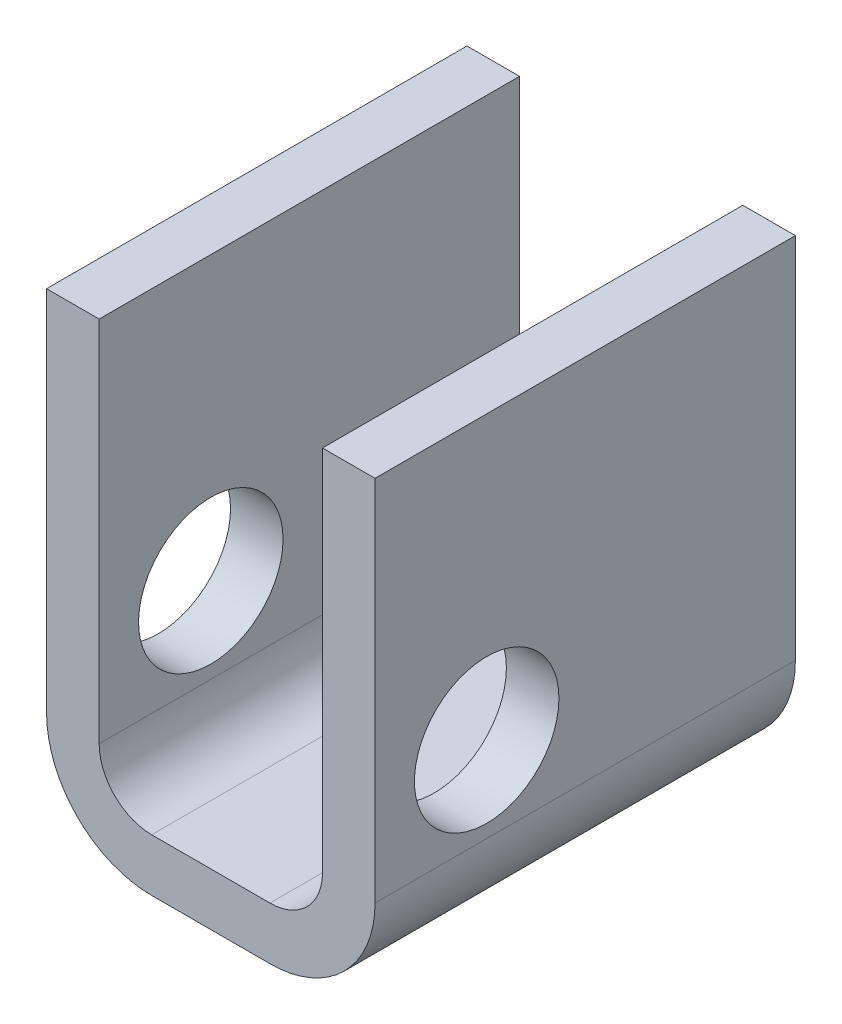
ISO-10303-21;
HEADER;
FILE_DESCRIPTION(('STEP AP214'),'2;1');
FILE_NAME('part.step','',(''),(''),'','','');
FILE_SCHEMA(('AUTOMOTIVE_DESIGN { 1 0 10303 214 1 1 1 1 }'));
ENDSEC;
DATA;
#1=APPLICATION_CONTEXT('core data for automotive mechanical design processes');
#2=APPLICATION_PROTOCOL_DEFINITION('international standard','automotive_design',2000,#1);
#3=PRODUCT_CONTEXT('',#1,'mechanical');
#4=PRODUCT('Part','Part','',(#3));
#5=PRODUCT_RELATED_PRODUCT_CATEGORY('part','',(#4));
#6=PRODUCT_DEFINITION_FORMATION('','',#4);
#7=PRODUCT_DEFINITION_CONTEXT('part definition',#1,'design');
#8=PRODUCT_DEFINITION('design','',#6,#7);
#9=PRODUCT_DEFINITION_SHAPE('','',#8);
#10=(LENGTH_UNIT() NAMED_UNIT(*) SI_UNIT(.MILLI.,.METRE.));
#11=(NAMED_UNIT(*) PLANE_ANGLE_UNIT() SI_UNIT($,.RADIAN.));
#12=(NAMED_UNIT(*) SI_UNIT($,.STERADIAN.) SOLID_ANGLE_UNIT());
#13=UNCERTAINTY_MEASURE_WITH_UNIT(LENGTH_MEASURE(1.E-05),#10,'distance_accuracy_value','');
#14=(GEOMETRIC_REPRESENTATION_CONTEXT(3) GLOBAL_UNCERTAINTY_ASSIGNED_CONTEXT((#13)) GLOBAL_UNIT_ASSIGNED_CONTEXT((#10,
#11,#12)) REPRESENTATION_CONTEXT('',''));
#15=CARTESIAN_POINT('',(0.,0.,0.));
#16=DIRECTION('',(0.,0.,1.));
#17=DIRECTION('',(1.,0.,0.));
#18=AXIS2_PLACEMENT_3D('',#15,#16,#17);
#19=CARTESIAN_POINT('',(13.49375,50.8,50.8));
#20=DIRECTION('',(0.,-1.,0.));
#21=DIRECTION('',(0.,0.,-1.));
#22=AXIS2_PLACEMENT_3D('',#19,#20,#21);
#23=PLANE('',#22);
#24=DIRECTION('',(-1.,0.,0.));
#25=VECTOR('',#24,1.);
#26=CARTESIAN_POINT('',(13.49375,50.8,0.));
#27=LINE('',#26,#25);
#28=CARTESIAN_POINT('',(19.84375,50.8,0.));
#29=VERTEX_POINT('',#28);
#30=CARTESIAN_POINT('',(13.49375,50.8,0.));
#31=VERTEX_POINT('',#30);
#32=EDGE_CURVE('E154',#29,#31,#27,.T.);
#33=ORIENTED_EDGE('',*,*,#32,.T.);
#34=DIRECTION('',(0.,0.,-1.));
#35=VECTOR('',#34,1.);
#36=CARTESIAN_POINT('',(13.49375,50.8,50.8));
#37=LINE('',#36,#35);
#38=CARTESIAN_POINT('',(13.49375,50.8,50.8));
#39=VERTEX_POINT('',#38);
#40=EDGE_CURVE('E11',#39,#31,#37,.T.);
#41=ORIENTED_EDGE('',*,*,#40,.F.);
#42=DIRECTION('',(-1.,0.,0.));
#43=VECTOR('',#42,1.);
#44=CARTESIAN_POINT('',(13.49375,50.8,50.8));
#45=LINE('',#44,#43);
#46=CARTESIAN_POINT('',(19.84375,50.8,50.8));
#47=VERTEX_POINT('',#46);
#48=EDGE_CURVE('E177',#47,#39,#45,.T.);
#49=ORIENTED_EDGE('',*,*,#48,.F.);
#50=DIRECTION('',(0.,0.,-1.));
#51=VECTOR('',#50,1.);
#52=CARTESIAN_POINT('',(19.84375,50.8,50.8));
#53=LINE('',#52,#51);
#54=EDGE_CURVE('E150',#47,#29,#53,.T.);
#55=ORIENTED_EDGE('',*,*,#54,.T.);
#56=EDGE_LOOP('',(#33,#41,#49,#55));
#57=FACE_BOUND('',#56,.T.);
#58=ADVANCED_FACE('F34',(#57),#23,.F.);
#59=CARTESIAN_POINT('',(13.49375,6.35,50.8));
#60=DIRECTION('',(1.,0.,0.));
#61=DIRECTION('',(0.,1.,0.));
#62=AXIS2_PLACEMENT_3D('',#59,#60,#61);
#63=PLANE('',#62);
#64=CARTESIAN_POINT('',(13.49375,16.66875,37.30625));
#65=DIRECTION('',(1.,0.,0.));
#66=DIRECTION('',(0.,1.,0.));
#67=AXIS2_PLACEMENT_3D('',#64,#65,#66);
#68=CIRCLE('',#67,8.73125);
#69=CARTESIAN_POINT('',(13.49375,25.4,37.30625));
#70=VERTEX_POINT('',#69);
#71=EDGE_CURVE('E158',#70,#70,#68,.T.);
#72=ORIENTED_EDGE('',*,*,#71,.T.);
#73=EDGE_LOOP('',(#72));
#74=FACE_BOUND('',#73,.T.);
#75=DIRECTION('',(0.,-1.,0.));
#76=VECTOR('',#75,1.);
#77=CARTESIAN_POINT('',(13.49375,6.35,0.));
#78=LINE('',#77,#76);
#79=CARTESIAN_POINT('',(13.49375,6.35,0.));
#80=VERTEX_POINT('',#79);
#81=EDGE_CURVE('E157',#31,#80,#78,.T.);
#82=ORIENTED_EDGE('',*,*,#81,.T.);
#83=DIRECTION('',(0.,0.,-1.));
#84=VECTOR('',#83,1.);
#85=CARTESIAN_POINT('',(13.49375,6.35,50.8));
#86=LINE('',#85,#84);
#87=CARTESIAN_POINT('',(13.49375,6.35,50.8));
#88=VERTEX_POINT('',#87);
#89=EDGE_CURVE('E42',#88,#80,#86,.T.);
#90=ORIENTED_EDGE('',*,*,#89,.F.);
#91=DIRECTION('',(0.,-1.,0.));
#92=VECTOR('',#91,1.);
#93=CARTESIAN_POINT('',(13.49375,6.35,50.8));
#94=LINE('',#93,#92);
#95=EDGE_CURVE('E105',#39,#88,#94,.T.);
#96=ORIENTED_EDGE('',*,*,#95,.F.);
#97=ORIENTED_EDGE('',*,*,#40,.T.);
#98=EDGE_LOOP('',(#82,#90,#96,#97));
#99=FACE_BOUND('',#98,.T.);
#100=ADVANCED_FACE('F257',(#74,#99),#63,.F.);
#101=CARTESIAN_POINT('',(7.14374999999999,6.35,50.8));
#102=DIRECTION('',(0.,0.,-1.));
#103=DIRECTION('',(-1.,0.,0.));
#104=AXIS2_PLACEMENT_3D('',#101,#102,#103);
#105=CYLINDRICAL_SURFACE('',#104,6.35);
#106=CARTESIAN_POINT('',(7.14374999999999,6.35,0.));
#107=DIRECTION('',(0.,0.,-1.));
#108=DIRECTION('',(1.,0.,0.));
#109=AXIS2_PLACEMENT_3D('',#106,#107,#108);
#110=CIRCLE('',#109,6.35);
#111=CARTESIAN_POINT('',(7.14374999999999,0.,0.));
#112=VERTEX_POINT('',#111);
#113=EDGE_CURVE('E160',#80,#112,#110,.T.);
#114=ORIENTED_EDGE('',*,*,#113,.T.);
#115=DIRECTION('',(0.,0.,-1.));
#116=VECTOR('',#115,1.);
#117=CARTESIAN_POINT('',(7.14374999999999,0.,50.8));
#118=LINE('',#117,#116);
#119=CARTESIAN_POINT('',(7.14374999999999,0.,50.8));
#120=VERTEX_POINT('',#119);
#121=EDGE_CURVE('E196',#120,#112,#118,.T.);
#122=ORIENTED_EDGE('',*,*,#121,.F.);
#123=CARTESIAN_POINT('',(7.14374999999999,6.35,50.8));
#124=DIRECTION('',(0.,0.,-1.));
#125=DIRECTION('',(1.,0.,0.));
#126=AXIS2_PLACEMENT_3D('',#123,#124,#125);
#127=CIRCLE('',#126,6.35);
#128=EDGE_CURVE('E204',#88,#120,#127,.T.);
#129=ORIENTED_EDGE('',*,*,#128,.F.);
#130=ORIENTED_EDGE('',*,*,#89,.T.);
#131=EDGE_LOOP('',(#114,#122,#129,#130));
#132=FACE_BOUND('',#131,.T.);
#133=ADVANCED_FACE('F202',(#132),#105,.F.);
#134=CARTESIAN_POINT('',(-7.14374999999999,0.,50.8));
#135=DIRECTION('',(0.,-1.,0.));
#136=DIRECTION('',(0.,0.,-1.));
#137=AXIS2_PLACEMENT_3D('',#134,#135,#136);
#138=PLANE('',#137);
#139=DIRECTION('',(-1.,0.,0.));
#140=VECTOR('',#139,1.);
#141=CARTESIAN_POINT('',(-7.14374999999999,0.,0.));
#142=LINE('',#141,#140);
#143=CARTESIAN_POINT('',(-7.14374999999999,0.,0.));
#144=VERTEX_POINT('',#143);
#145=EDGE_CURVE('E162',#112,#144,#142,.T.);
#146=ORIENTED_EDGE('',*,*,#145,.T.);
#147=DIRECTION('',(0.,0.,-1.));
#148=VECTOR('',#147,1.);
#149=CARTESIAN_POINT('',(-7.14374999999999,0.,50.8));
#150=LINE('',#149,#148);
#151=CARTESIAN_POINT('',(-7.14374999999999,0.,50.8));
#152=VERTEX_POINT('',#151);
#153=EDGE_CURVE('E193',#152,#144,#150,.T.);
#154=ORIENTED_EDGE('',*,*,#153,.F.);
#155=DIRECTION('',(-1.,0.,0.));
#156=VECTOR('',#155,1.);
#157=CARTESIAN_POINT('',(-7.14374999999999,0.,50.8));
#158=LINE('',#157,#156);
#159=EDGE_CURVE('E222',#120,#152,#158,.T.);
#160=ORIENTED_EDGE('',*,*,#159,.F.);
#161=ORIENTED_EDGE('',*,*,#121,.T.);
#162=EDGE_LOOP('',(#146,#154,#160,#161));
#163=FACE_BOUND('',#162,.T.);
#164=ADVANCED_FACE('F213',(#163),#138,.F.);
#165=CARTESIAN_POINT('',(-7.14374999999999,6.35,50.8));
#166=DIRECTION('',(0.,0.,-1.));
#167=DIRECTION('',(-1.,0.,0.));
#168=AXIS2_PLACEMENT_3D('',#165,#166,#167);
#169=CYLINDRICAL_SURFACE('',#168,6.35);
#170=CARTESIAN_POINT('',(-7.14374999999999,6.35,0.));
#171=DIRECTION('',(0.,0.,-1.));
#172=DIRECTION('',(-1.,0.,0.));
#173=AXIS2_PLACEMENT_3D('',#170,#171,#172);
#174=CIRCLE('',#173,6.35);
#175=CARTESIAN_POINT('',(-13.49375,6.35,0.));
#176=VERTEX_POINT('',#175);
#177=EDGE_CURVE('E164',#144,#176,#174,.T.);
#178=ORIENTED_EDGE('',*,*,#177,.T.);
#179=DIRECTION('',(0.,0.,-1.));
#180=VECTOR('',#179,1.);
#181=CARTESIAN_POINT('',(-13.49375,6.35,50.8));
#182=LINE('',#181,#180);
#183=CARTESIAN_POINT('',(-13.49375,6.35,50.8));
#184=VERTEX_POINT('',#183);
#185=EDGE_CURVE('E190',#184,#176,#182,.T.);
#186=ORIENTED_EDGE('',*,*,#185,.F.);
#187=CARTESIAN_POINT('',(-7.14374999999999,6.35,50.8));
#188=DIRECTION('',(0.,0.,-1.));
#189=DIRECTION('',(-1.,0.,0.));
#190=AXIS2_PLACEMENT_3D('',#187,#188,#189);
#191=CIRCLE('',#190,6.35);
#192=EDGE_CURVE('E219',#152,#184,#191,.T.);
#193=ORIENTED_EDGE('',*,*,#192,.F.);
#194=ORIENTED_EDGE('',*,*,#153,.T.);
#195=EDGE_LOOP('',(#178,#186,#193,#194));
#196=FACE_BOUND('',#195,.T.);
#197=ADVANCED_FACE('F217',(#196),#169,.F.);
#198=CARTESIAN_POINT('',(-13.49375,50.8,50.8));
#199=DIRECTION('',(-1.,0.,0.));
#200=DIRECTION('',(0.,-1.,0.));
#201=AXIS2_PLACEMENT_3D('',#198,#199,#200);
#202=PLANE('',#201);
#203=CARTESIAN_POINT('',(-13.49375,16.66875,37.30625));
#204=DIRECTION('',(-1.,0.,0.));
#205=DIRECTION('',(0.,-1.,0.));
#206=AXIS2_PLACEMENT_3D('',#203,#204,#205);
#207=CIRCLE('',#206,8.73125);
#208=CARTESIAN_POINT('',(-13.49375,7.93749999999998,37.30625));
#209=VERTEX_POINT('',#208);
#210=EDGE_CURVE('E361',#209,#209,#207,.T.);
#211=ORIENTED_EDGE('',*,*,#210,.T.);
#212=EDGE_LOOP('',(#211));
#213=FACE_BOUND('',#212,.T.);
#214=DIRECTION('',(0.,1.,0.));
#215=VECTOR('',#214,1.);
#216=CARTESIAN_POINT('',(-13.49375,50.8,0.));
#217=LINE('',#216,#215);
#218=CARTESIAN_POINT('',(-13.49375,50.8,0.));
#219=VERTEX_POINT('',#218);
#220=EDGE_CURVE('E166',#176,#219,#217,.T.);
#221=ORIENTED_EDGE('',*,*,#220,.T.);
#222=DIRECTION('',(0.,0.,-1.));
#223=VECTOR('',#222,1.);
#224=CARTESIAN_POINT('',(-13.49375,50.8,50.8));
#225=LINE('',#224,#223);
#226=CARTESIAN_POINT('',(-13.49375,50.8,50.8));
#227=VERTEX_POINT('',#226);
#228=EDGE_CURVE('E187',#227,#219,#225,.T.);
#229=ORIENTED_EDGE('',*,*,#228,.F.);
#230=DIRECTION('',(0.,1.,0.));
#231=VECTOR('',#230,1.);
#232=CARTESIAN_POINT('',(-13.49375,50.8,50.8));
#233=LINE('',#232,#231);
#234=EDGE_CURVE('E221',#184,#227,#233,.T.);
#235=ORIENTED_EDGE('',*,*,#234,.F.);
#236=ORIENTED_EDGE('',*,*,#185,.T.);
#237=EDGE_LOOP('',(#221,#229,#235,#236));
#238=FACE_BOUND('',#237,.T.);
#239=ADVANCED_FACE('F272',(#213,#238),#202,.F.);
#240=CARTESIAN_POINT('',(-19.84375,50.8,50.8));
#241=DIRECTION('',(0.,-1.,0.));
#242=DIRECTION('',(0.,0.,-1.));
#243=AXIS2_PLACEMENT_3D('',#240,#241,#242);
#244=PLANE('',#243);
#245=DIRECTION('',(-1.,0.,0.));
#246=VECTOR('',#245,1.);
#247=CARTESIAN_POINT('',(-19.84375,50.8,0.));
#248=LINE('',#247,#246);
#249=CARTESIAN_POINT('',(-19.84375,50.8,0.));
#250=VERTEX_POINT('',#249);
#251=EDGE_CURVE('E168',#219,#250,#248,.T.);
#252=ORIENTED_EDGE('',*,*,#251,.T.);
#253=DIRECTION('',(0.,0.,-1.));
#254=VECTOR('',#253,1.);
#255=CARTESIAN_POINT('',(-19.84375,50.8,50.8));
#256=LINE('',#255,#254);
#257=CARTESIAN_POINT('',(-19.84375,50.8,50.8));
#258=VERTEX_POINT('',#257);
#259=EDGE_CURVE('E184',#258,#250,#256,.T.);
#260=ORIENTED_EDGE('',*,*,#259,.F.);
#261=DIRECTION('',(-1.,0.,0.));
#262=VECTOR('',#261,1.);
#263=CARTESIAN_POINT('',(-19.84375,50.8,50.8));
#264=LINE('',#263,#262);
#265=EDGE_CURVE('E224',#227,#258,#264,.T.);
#266=ORIENTED_EDGE('',*,*,#265,.F.);
#267=ORIENTED_EDGE('',*,*,#228,.T.);
#268=EDGE_LOOP('',(#252,#260,#266,#267));
#269=FACE_BOUND('',#268,.T.);
#270=ADVANCED_FACE('F275',(#269),#244,.F.);
#271=CARTESIAN_POINT('',(-19.84375,6.35,50.8));
#272=DIRECTION('',(1.,0.,0.));
#273=DIRECTION('',(0.,1.,0.));
#274=AXIS2_PLACEMENT_3D('',#271,#272,#273);
#275=PLANE('',#274);
#276=CARTESIAN_POINT('',(-19.84375,16.66875,37.30625));
#277=DIRECTION('',(1.,0.,0.));
#278=DIRECTION('',(0.,0.,-1.));
#279=AXIS2_PLACEMENT_3D('',#276,#277,#278);
#280=CIRCLE('',#279,8.73125);
#281=CARTESIAN_POINT('',(-19.84375,16.66875,28.575));
#282=VERTEX_POINT('',#281);
#283=EDGE_CURVE('E358',#282,#282,#280,.T.);
#284=ORIENTED_EDGE('',*,*,#283,.T.);
#285=EDGE_LOOP('',(#284));
#286=FACE_BOUND('',#285,.T.);
#287=DIRECTION('',(0.,-1.,0.));
#288=VECTOR('',#287,1.);
#289=CARTESIAN_POINT('',(-19.84375,6.35,0.));
#290=LINE('',#289,#288);
#291=CARTESIAN_POINT('',(-19.84375,6.35,0.));
#292=VERTEX_POINT('',#291);
#293=EDGE_CURVE('E170',#250,#292,#290,.T.);
#294=ORIENTED_EDGE('',*,*,#293,.T.);
#295=DIRECTION('',(0.,0.,-1.));
#296=VECTOR('',#295,1.);
#297=CARTESIAN_POINT('',(-19.84375,6.35,50.8));
#298=LINE('',#297,#296);
#299=CARTESIAN_POINT('',(-19.84375,6.35,50.8));
#300=VERTEX_POINT('',#299);
#301=EDGE_CURVE('E181',#300,#292,#298,.T.);
#302=ORIENTED_EDGE('',*,*,#301,.F.);
#303=DIRECTION('',(0.,-1.,0.));
#304=VECTOR('',#303,1.);
#305=CARTESIAN_POINT('',(-19.84375,6.35,50.8));
#306=LINE('',#305,#304);
#307=EDGE_CURVE('E230',#258,#300,#306,.T.);
#308=ORIENTED_EDGE('',*,*,#307,.F.);
#309=ORIENTED_EDGE('',*,*,#259,.T.);
#310=EDGE_LOOP('',(#294,#302,#308,#309));
#311=FACE_BOUND('',#310,.T.);
#312=ADVANCED_FACE('F236',(#286,#311),#275,.F.);
#313=CARTESIAN_POINT('',(-7.14374999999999,6.35,50.8));
#314=DIRECTION('',(0.,0.,-1.));
#315=DIRECTION('',(-1.,0.,0.));
#316=AXIS2_PLACEMENT_3D('',#313,#314,#315);
#317=CYLINDRICAL_SURFACE('',#316,12.7);
#318=CARTESIAN_POINT('',(-7.14374999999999,6.35,0.));
#319=DIRECTION('',(0.,0.,1.));
#320=DIRECTION('',(-1.,0.,0.));
#321=AXIS2_PLACEMENT_3D('',#318,#319,#320);
#322=CIRCLE('',#321,12.7);
#323=CARTESIAN_POINT('',(-7.14374999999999,-6.35,0.));
#324=VERTEX_POINT('',#323);
#325=EDGE_CURVE('E172',#292,#324,#322,.T.);
#326=ORIENTED_EDGE('',*,*,#325,.T.);
#327=DIRECTION('',(0.,0.,-1.));
#328=VECTOR('',#327,1.);
#329=CARTESIAN_POINT('',(-7.14374999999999,-6.35,50.8));
#330=LINE('',#329,#328);
#331=CARTESIAN_POINT('',(-7.14374999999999,-6.35,50.8));
#332=VERTEX_POINT('',#331);
#333=EDGE_CURVE('E145',#332,#324,#330,.T.);
#334=ORIENTED_EDGE('',*,*,#333,.F.);
#335=CARTESIAN_POINT('',(-7.14374999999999,6.35,50.8));
#336=DIRECTION('',(0.,0.,1.));
#337=DIRECTION('',(-1.,0.,0.));
#338=AXIS2_PLACEMENT_3D('',#335,#336,#337);
#339=CIRCLE('',#338,12.7);
#340=EDGE_CURVE('E136',#300,#332,#339,.T.);
#341=ORIENTED_EDGE('',*,*,#340,.F.);
#342=ORIENTED_EDGE('',*,*,#301,.T.);
#343=EDGE_LOOP('',(#326,#334,#341,#342));
#344=FACE_BOUND('',#343,.T.);
#345=ADVANCED_FACE('F240',(#344),#317,.T.);
#346=CARTESIAN_POINT('',(-7.14374999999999,-6.35,50.8));
#347=DIRECTION('',(0.,1.,0.));
#348=DIRECTION('',(0.,0.,1.));
#349=AXIS2_PLACEMENT_3D('',#346,#347,#348);
#350=PLANE('',#349);
#351=DIRECTION('',(1.,0.,0.));
#352=VECTOR('',#351,1.);
#353=CARTESIAN_POINT('',(-7.14374999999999,-6.35,0.));
#354=LINE('',#353,#352);
#355=CARTESIAN_POINT('',(7.14374999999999,-6.35,0.));
#356=VERTEX_POINT('',#355);
#357=EDGE_CURVE('E144',#324,#356,#354,.T.);
#358=ORIENTED_EDGE('',*,*,#357,.T.);
#359=DIRECTION('',(0.,0.,-1.));
#360=VECTOR('',#359,1.);
#361=CARTESIAN_POINT('',(7.14374999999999,-6.35,50.8));
#362=LINE('',#361,#360);
#363=CARTESIAN_POINT('',(7.14374999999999,-6.35,50.8));
#364=VERTEX_POINT('',#363);
#365=EDGE_CURVE('E141',#364,#356,#362,.T.);
#366=ORIENTED_EDGE('',*,*,#365,.F.);
#367=DIRECTION('',(1.,0.,0.));
#368=VECTOR('',#367,1.);
#369=CARTESIAN_POINT('',(-7.14374999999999,-6.35,50.8));
#370=LINE('',#369,#368);
#371=EDGE_CURVE('E130',#332,#364,#370,.T.);
#372=ORIENTED_EDGE('',*,*,#371,.F.);
#373=ORIENTED_EDGE('',*,*,#333,.T.);
#374=EDGE_LOOP('',(#358,#366,#372,#373));
#375=FACE_BOUND('',#374,.T.);
#376=ADVANCED_FACE('F142',(#375),#350,.F.);
#377=CARTESIAN_POINT('',(7.14374999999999,6.35,50.8));
#378=DIRECTION('',(0.,0.,-1.));
#379=DIRECTION('',(-1.,0.,0.));
#380=AXIS2_PLACEMENT_3D('',#377,#378,#379);
#381=CYLINDRICAL_SURFACE('',#380,12.7);
#382=CARTESIAN_POINT('',(7.14374999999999,6.35,0.));
#383=DIRECTION('',(0.,0.,1.));
#384=DIRECTION('',(1.,0.,0.));
#385=AXIS2_PLACEMENT_3D('',#382,#383,#384);
#386=CIRCLE('',#385,12.7);
#387=CARTESIAN_POINT('',(19.84375,6.35,0.));
#388=VERTEX_POINT('',#387);
#389=EDGE_CURVE('E91',#356,#388,#386,.T.);
#390=ORIENTED_EDGE('',*,*,#389,.T.);
#391=DIRECTION('',(0.,0.,-1.));
#392=VECTOR('',#391,1.);
#393=CARTESIAN_POINT('',(19.84375,6.35,50.8));
#394=LINE('',#393,#392);
#395=CARTESIAN_POINT('',(19.84375,6.35,50.8));
#396=VERTEX_POINT('',#395);
#397=EDGE_CURVE('E146',#396,#388,#394,.T.);
#398=ORIENTED_EDGE('',*,*,#397,.F.);
#399=CARTESIAN_POINT('',(7.14374999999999,6.35,50.8));
#400=DIRECTION('',(0.,0.,1.));
#401=DIRECTION('',(1.,0.,0.));
#402=AXIS2_PLACEMENT_3D('',#399,#400,#401);
#403=CIRCLE('',#402,12.7);
#404=EDGE_CURVE('E134',#364,#396,#403,.T.);
#405=ORIENTED_EDGE('',*,*,#404,.F.);
#406=ORIENTED_EDGE('',*,*,#365,.T.);
#407=EDGE_LOOP('',(#390,#398,#405,#406));
#408=FACE_BOUND('',#407,.T.);
#409=ADVANCED_FACE('F148',(#408),#381,.T.);
#410=CARTESIAN_POINT('',(19.84375,6.35,50.8));
#411=DIRECTION('',(-1.,0.,0.));
#412=DIRECTION('',(0.,0.,1.));
#413=AXIS2_PLACEMENT_3D('',#410,#411,#412);
#414=PLANE('',#413);
#415=CARTESIAN_POINT('',(19.84375,16.66875,37.30625));
#416=DIRECTION('',(1.,0.,0.));
#417=DIRECTION('',(0.,0.,-1.));
#418=AXIS2_PLACEMENT_3D('',#415,#416,#417);
#419=CIRCLE('',#418,8.73125);
#420=CARTESIAN_POINT('',(19.84375,16.66875,28.575));
#421=VERTEX_POINT('',#420);
#422=EDGE_CURVE('E364',#421,#421,#419,.T.);
#423=ORIENTED_EDGE('',*,*,#422,.F.);
#424=EDGE_LOOP('',(#423));
#425=FACE_BOUND('',#424,.T.);
#426=DIRECTION('',(0.,1.,0.));
#427=VECTOR('',#426,1.);
#428=CARTESIAN_POINT('',(19.84375,6.35,0.));
#429=LINE('',#428,#427);
#430=EDGE_CURVE('E97',#388,#29,#429,.T.);
#431=ORIENTED_EDGE('',*,*,#430,.T.);
#432=ORIENTED_EDGE('',*,*,#54,.F.);
#433=DIRECTION('',(0.,1.,0.));
#434=VECTOR('',#433,1.);
#435=CARTESIAN_POINT('',(19.84375,6.35,50.8));
#436=LINE('',#435,#434);
#437=EDGE_CURVE('E50',#396,#47,#436,.T.);
#438=ORIENTED_EDGE('',*,*,#437,.F.);
#439=ORIENTED_EDGE('',*,*,#397,.T.);
#440=EDGE_LOOP('',(#431,#432,#438,#439));
#441=FACE_BOUND('',#440,.T.);
#442=ADVANCED_FACE('F244',(#425,#441),#414,.F.);
#443=CARTESIAN_POINT('',(7.14374999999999,6.35,50.8));
#444=DIRECTION('',(0.,0.,1.));
#445=DIRECTION('',(1.,0.,0.));
#446=AXIS2_PLACEMENT_3D('',#443,#444,#445);
#447=PLANE('',#446);
#448=ORIENTED_EDGE('',*,*,#48,.T.);
#449=ORIENTED_EDGE('',*,*,#95,.T.);
#450=ORIENTED_EDGE('',*,*,#128,.T.);
#451=ORIENTED_EDGE('',*,*,#159,.T.);
#452=ORIENTED_EDGE('',*,*,#192,.T.);
#453=ORIENTED_EDGE('',*,*,#234,.T.);
#454=ORIENTED_EDGE('',*,*,#265,.T.);
#455=ORIENTED_EDGE('',*,*,#307,.T.);
#456=ORIENTED_EDGE('',*,*,#340,.T.);
#457=ORIENTED_EDGE('',*,*,#371,.T.);
#458=ORIENTED_EDGE('',*,*,#404,.T.);
#459=ORIENTED_EDGE('',*,*,#437,.T.);
#460=EDGE_LOOP('',(#448,#449,#450,#451,#452,#453,#454,#455,#456,#457,#458,#459));
#461=FACE_BOUND('',#460,.T.);
#462=ADVANCED_FACE('F132',(#461),#447,.T.);
#463=CARTESIAN_POINT('',(7.14374999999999,6.35,0.));
#464=DIRECTION('',(0.,0.,1.));
#465=DIRECTION('',(1.,0.,0.));
#466=AXIS2_PLACEMENT_3D('',#463,#464,#465);
#467=PLANE('',#466);
#468=ORIENTED_EDGE('',*,*,#32,.F.);
#469=ORIENTED_EDGE('',*,*,#430,.F.);
#470=ORIENTED_EDGE('',*,*,#389,.F.);
#471=ORIENTED_EDGE('',*,*,#357,.F.);
#472=ORIENTED_EDGE('',*,*,#325,.F.);
#473=ORIENTED_EDGE('',*,*,#293,.F.);
#474=ORIENTED_EDGE('',*,*,#251,.F.);
#475=ORIENTED_EDGE('',*,*,#220,.F.);
#476=ORIENTED_EDGE('',*,*,#177,.F.);
#477=ORIENTED_EDGE('',*,*,#145,.F.);
#478=ORIENTED_EDGE('',*,*,#113,.F.);
#479=ORIENTED_EDGE('',*,*,#81,.F.);
#480=EDGE_LOOP('',(#468,#469,#470,#471,#472,#473,#474,#475,#476,#477,#478,#479));
#481=FACE_BOUND('',#480,.T.);
#482=ADVANCED_FACE('F208',(#481),#467,.F.);
#483=CARTESIAN_POINT('',(-19.84375,16.66875,37.30625));
#484=DIRECTION('',(1.,0.,0.));
#485=DIRECTION('',(0.,0.,-1.));
#486=AXIS2_PLACEMENT_3D('',#483,#484,#485);
#487=CYLINDRICAL_SURFACE('',#486,8.73125);
#488=ORIENTED_EDGE('',*,*,#422,.T.);
#489=EDGE_LOOP('',(#488));
#490=FACE_BOUND('',#489,.T.);
#491=ORIENTED_EDGE('',*,*,#71,.F.);
#492=EDGE_LOOP('',(#491));
#493=FACE_BOUND('',#492,.T.);
#494=ADVANCED_FACE('F309',(#490,#493),#487,.F.);
#495=ORIENTED_EDGE('',*,*,#283,.F.);
#496=EDGE_LOOP('',(#495));
#497=FACE_BOUND('',#496,.T.);
#498=ORIENTED_EDGE('',*,*,#210,.F.);
#499=EDGE_LOOP('',(#498));
#500=FACE_BOUND('',#499,.T.);
#501=ADVANCED_FACE('F342',(#497,#500),#487,.F.);
#502=CLOSED_SHELL('',(#58,#100,#133,#164,#197,#239,#270,#312,#345,#376,#409,#442,#462,#482,#494,#501));
#503=MANIFOLD_SOLID_BREP('B2',#502);
#504=ADVANCED_BREP_SHAPE_REPRESENTATION('',(#18,#503),#14);
#505=SHAPE_DEFINITION_REPRESENTATION(#9,#504);
ENDSEC;
END-ISO-10303-21;
